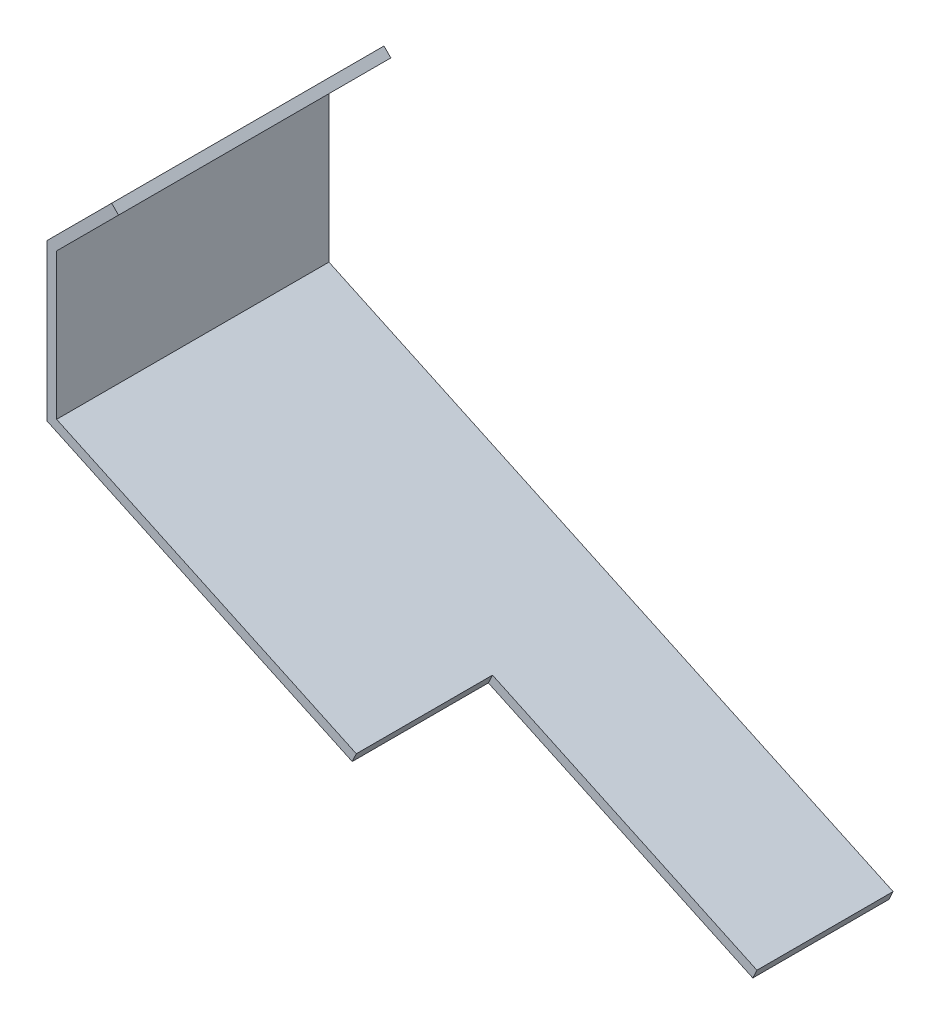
from build123d import *

# Parameters (mm, degrees)
EXTRU_MINCE1_DEPTH      = 70
ESQUISSE5_W             = 150
ESQUISSE5_H             = 70
ENL_V_MAT_EXTRU_1_DEPTH = 10


with BuildPart() as part:
    # Esquisse1 → Extru.-Mince1 (new, symmetric)
    with BuildSketch(Plane.XY):
        Polygon((290.018491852, -135.237843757), (0, 0), (0, 75), (31.819805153, 106.819805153), (28.284271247, 110.355339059), (-5, 77.071067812), (-5, -3.185351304), (287.905400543, -139.769382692), align=None)
    extrude(amount=EXTRU_MINCE1_DEPTH, both=True)

    # Esquisse5 → Enl_v. mat.-Extru.1 (cut)
    with BuildSketch(Plane(origin=(-2.113091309, -4.531538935, 0), x_dir=(0.9063077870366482, -0.42261826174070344, 0), z_dir=(-0.4226182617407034, -0.906307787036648, 0))):
        with Locations((245, 35)):
            Rectangle(ESQUISSE5_W, ESQUISSE5_H)
    extrude(amount=-ENL_V_MAT_EXTRU_1_DEPTH, mode=Mode.SUBTRACT)


solid = part.part
